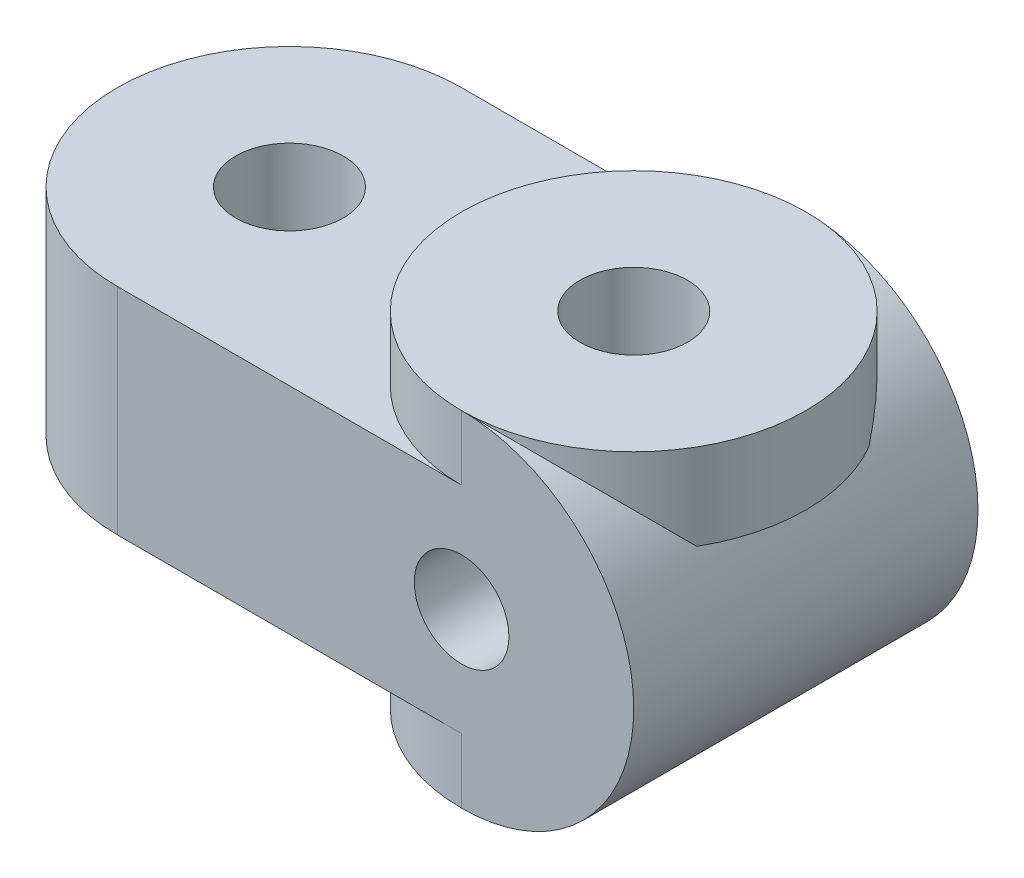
ISO-10303-21;
HEADER;
FILE_DESCRIPTION(('STEP AP214'),'2;1');
FILE_NAME('part.step','',(''),(''),'','','');
FILE_SCHEMA(('AUTOMOTIVE_DESIGN { 1 0 10303 214 1 1 1 1 }'));
ENDSEC;
DATA;
#1=APPLICATION_CONTEXT('core data for automotive mechanical design processes');
#2=APPLICATION_PROTOCOL_DEFINITION('international standard','automotive_design',2000,#1);
#3=PRODUCT_CONTEXT('',#1,'mechanical');
#4=PRODUCT('Part','Part','',(#3));
#5=PRODUCT_RELATED_PRODUCT_CATEGORY('part','',(#4));
#6=PRODUCT_DEFINITION_FORMATION('','',#4);
#7=PRODUCT_DEFINITION_CONTEXT('part definition',#1,'design');
#8=PRODUCT_DEFINITION('design','',#6,#7);
#9=PRODUCT_DEFINITION_SHAPE('','',#8);
#10=(LENGTH_UNIT() NAMED_UNIT(*) SI_UNIT(.MILLI.,.METRE.));
#11=(NAMED_UNIT(*) PLANE_ANGLE_UNIT() SI_UNIT($,.RADIAN.));
#12=(NAMED_UNIT(*) SI_UNIT($,.STERADIAN.) SOLID_ANGLE_UNIT());
#13=UNCERTAINTY_MEASURE_WITH_UNIT(LENGTH_MEASURE(1.E-05),#10,'distance_accuracy_value','');
#14=(GEOMETRIC_REPRESENTATION_CONTEXT(3) GLOBAL_UNCERTAINTY_ASSIGNED_CONTEXT((#13)) GLOBAL_UNIT_ASSIGNED_CONTEXT((#10,
#11,#12)) REPRESENTATION_CONTEXT('',''));
#15=CARTESIAN_POINT('',(0.,0.,0.));
#16=DIRECTION('',(0.,0.,1.));
#17=DIRECTION('',(1.,0.,0.));
#18=AXIS2_PLACEMENT_3D('',#15,#16,#17);
#19=CARTESIAN_POINT('',(-8.,-4.,-4.));
#20=DIRECTION('',(0.,1.,0.));
#21=DIRECTION('',(0.,0.,1.));
#22=AXIS2_PLACEMENT_3D('',#19,#20,#21);
#23=CYLINDRICAL_SURFACE('',#22,1.25);
#24=CARTESIAN_POINT('',(-8.,2.5,-4.));
#25=DIRECTION('',(0.,1.,0.));
#26=DIRECTION('',(0.,0.,1.));
#27=AXIS2_PLACEMENT_3D('',#24,#25,#26);
#28=CIRCLE('',#27,1.25);
#29=CARTESIAN_POINT('',(-8.,2.5,-2.75));
#30=VERTEX_POINT('',#29);
#31=EDGE_CURVE('E224',#30,#30,#28,.F.);
#32=ORIENTED_EDGE('',*,*,#31,.F.);
#33=EDGE_LOOP('',(#32));
#34=FACE_BOUND('',#33,.T.);
#35=CARTESIAN_POINT('',(-8.,-2.5,-4.));
#36=DIRECTION('',(0.,1.,0.));
#37=DIRECTION('',(0.,0.,1.));
#38=AXIS2_PLACEMENT_3D('',#35,#36,#37);
#39=CIRCLE('',#38,1.25);
#40=CARTESIAN_POINT('',(-8.,-2.5,-2.75));
#41=VERTEX_POINT('',#40);
#42=EDGE_CURVE('E227',#41,#41,#39,.F.);
#43=ORIENTED_EDGE('',*,*,#42,.T.);
#44=EDGE_LOOP('',(#43));
#45=FACE_BOUND('',#44,.T.);
#46=ADVANCED_FACE('F60',(#34,#45),#23,.F.);
#47=CARTESIAN_POINT('',(-8.,-4.,-4.));
#48=DIRECTION('',(0.,1.,0.));
#49=DIRECTION('',(0.,0.,1.));
#50=AXIS2_PLACEMENT_3D('',#47,#48,#49);
#51=CYLINDRICAL_SURFACE('',#50,4.);
#52=DIRECTION('',(0.,1.,0.));
#53=VECTOR('',#52,1.);
#54=CARTESIAN_POINT('',(-8.,-4.,-8.));
#55=LINE('',#54,#53);
#56=CARTESIAN_POINT('',(-8.,-2.5,-8.));
#57=VERTEX_POINT('',#56);
#58=CARTESIAN_POINT('',(-8.,2.5,-8.));
#59=VERTEX_POINT('',#58);
#60=EDGE_CURVE('E86',#57,#59,#55,.T.);
#61=ORIENTED_EDGE('',*,*,#60,.F.);
#62=CARTESIAN_POINT('',(-8.,-2.5,-4.));
#63=DIRECTION('',(0.,1.,0.));
#64=DIRECTION('',(0.,0.,1.));
#65=AXIS2_PLACEMENT_3D('',#62,#63,#64);
#66=CIRCLE('',#65,4.);
#67=CARTESIAN_POINT('',(-8.,-2.5,0.));
#68=VERTEX_POINT('',#67);
#69=EDGE_CURVE('E132',#57,#68,#66,.T.);
#70=ORIENTED_EDGE('',*,*,#69,.T.);
#71=DIRECTION('',(0.,1.,0.));
#72=VECTOR('',#71,1.);
#73=CARTESIAN_POINT('',(-8.,-4.,0.));
#74=LINE('',#73,#72);
#75=CARTESIAN_POINT('',(-8.,2.5,0.));
#76=VERTEX_POINT('',#75);
#77=EDGE_CURVE('E140',#68,#76,#74,.T.);
#78=ORIENTED_EDGE('',*,*,#77,.T.);
#79=CARTESIAN_POINT('',(-8.,2.5,-4.));
#80=DIRECTION('',(0.,1.,0.));
#81=DIRECTION('',(0.,0.,1.));
#82=AXIS2_PLACEMENT_3D('',#79,#80,#81);
#83=CIRCLE('',#82,4.);
#84=EDGE_CURVE('E242',#59,#76,#83,.T.);
#85=ORIENTED_EDGE('',*,*,#84,.F.);
#86=EDGE_LOOP('',(#61,#70,#78,#85));
#87=FACE_BOUND('',#86,.T.);
#88=ADVANCED_FACE('F138',(#87),#51,.T.);
#89=CARTESIAN_POINT('',(-12.,4.,-8.));
#90=DIRECTION('',(0.,1.,0.));
#91=DIRECTION('',(0.,0.,1.));
#92=AXIS2_PLACEMENT_3D('',#89,#90,#91);
#93=PLANE('',#92);
#94=CARTESIAN_POINT('',(0.,4.,-4.));
#95=DIRECTION('',(0.,1.,0.));
#96=DIRECTION('',(0.,0.,1.));
#97=AXIS2_PLACEMENT_3D('',#94,#95,#96);
#98=CIRCLE('',#97,1.25);
#99=CARTESIAN_POINT('',(0.,4.,-2.75));
#100=VERTEX_POINT('',#99);
#101=EDGE_CURVE('E273',#100,#100,#98,.T.);
#102=ORIENTED_EDGE('',*,*,#101,.F.);
#103=EDGE_LOOP('',(#102));
#104=FACE_BOUND('',#103,.T.);
#105=CARTESIAN_POINT('',(0.,4.,-4.));
#106=DIRECTION('',(0.,1.,0.));
#107=DIRECTION('',(0.,0.,1.));
#108=AXIS2_PLACEMENT_3D('',#105,#106,#107);
#109=CIRCLE('',#108,4.);
#110=CARTESIAN_POINT('',(0.,4.,0.));
#111=VERTEX_POINT('',#110);
#112=CARTESIAN_POINT('',(0.,4.,-8.));
#113=VERTEX_POINT('',#112);
#114=EDGE_CURVE('E183',#111,#113,#109,.T.);
#115=ORIENTED_EDGE('',*,*,#114,.T.);
#116=CARTESIAN_POINT('',(0.,4.,-4.));
#117=DIRECTION('',(0.,1.,0.));
#118=DIRECTION('',(0.,0.,1.));
#119=AXIS2_PLACEMENT_3D('',#116,#117,#118);
#120=CIRCLE('',#119,4.);
#121=EDGE_CURVE('E236',#113,#111,#120,.T.);
#122=ORIENTED_EDGE('',*,*,#121,.T.);
#123=EDGE_LOOP('',(#115,#122));
#124=FACE_BOUND('',#123,.T.);
#125=ADVANCED_FACE('F197',(#104,#124),#93,.T.);
#126=CARTESIAN_POINT('',(-12.,-4.,-8.));
#127=DIRECTION('',(0.,-1.,0.));
#128=DIRECTION('',(0.,0.,-1.));
#129=AXIS2_PLACEMENT_3D('',#126,#127,#128);
#130=PLANE('',#129);
#131=CARTESIAN_POINT('',(0.,-4.,-4.));
#132=DIRECTION('',(0.,1.,0.));
#133=DIRECTION('',(0.,0.,1.));
#134=AXIS2_PLACEMENT_3D('',#131,#132,#133);
#135=CIRCLE('',#134,4.);
#136=CARTESIAN_POINT('',(0.,-4.,-8.));
#137=VERTEX_POINT('',#136);
#138=CARTESIAN_POINT('',(0.,-4.,0.));
#139=VERTEX_POINT('',#138);
#140=EDGE_CURVE('E234',#137,#139,#135,.T.);
#141=ORIENTED_EDGE('',*,*,#140,.F.);
#142=DIRECTION('',(0.,0.,-1.));
#143=VECTOR('',#142,1.);
#144=CARTESIAN_POINT('',(0.,-4.,-8.));
#145=LINE('',#144,#143);
#146=CARTESIAN_POINT('',(0.,-4.,-5.25));
#147=VERTEX_POINT('',#146);
#148=EDGE_CURVE('E262',#147,#137,#145,.T.);
#149=ORIENTED_EDGE('',*,*,#148,.F.);
#150=CARTESIAN_POINT('',(0.,-4.,-4.));
#151=DIRECTION('',(0.,1.,0.));
#152=DIRECTION('',(0.,0.,1.));
#153=AXIS2_PLACEMENT_3D('',#150,#151,#152);
#154=CIRCLE('',#153,1.25);
#155=CARTESIAN_POINT('',(0.,-4.,-2.75));
#156=VERTEX_POINT('',#155);
#157=EDGE_CURVE('E150',#147,#156,#154,.T.);
#158=ORIENTED_EDGE('',*,*,#157,.T.);
#159=EDGE_CURVE('E279',#139,#156,#145,.T.);
#160=ORIENTED_EDGE('',*,*,#159,.F.);
#161=EDGE_LOOP('',(#141,#149,#158,#160));
#162=FACE_BOUND('',#161,.T.);
#163=ADVANCED_FACE('F200',(#162),#130,.T.);
#164=CARTESIAN_POINT('',(0.,0.,-8.));
#165=DIRECTION('',(0.,0.,1.));
#166=DIRECTION('',(1.,0.,0.));
#167=AXIS2_PLACEMENT_3D('',#164,#165,#166);
#168=CYLINDRICAL_SURFACE('',#167,1.1);
#169=CARTESIAN_POINT('',(0.,1.1,-2.75));
#170=CARTESIAN_POINT('',(0.0513412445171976,1.09999573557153,-2.75000419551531));
#171=CARTESIAN_POINT('',(0.102726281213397,1.09637585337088,-2.75319290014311));
#172=CARTESIAN_POINT('',(0.203784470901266,1.08216750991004,-2.76566800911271));
#173=CARTESIAN_POINT('',(0.253455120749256,1.07156927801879,-2.7749629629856));
#174=CARTESIAN_POINT('',(0.349348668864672,1.04423498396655,-2.79879968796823));
#175=CARTESIAN_POINT('',(0.395591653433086,1.02753876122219,-2.81330739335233));
#176=CARTESIAN_POINT('',(0.48414179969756,0.988910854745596,-2.84659238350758));
#177=CARTESIAN_POINT('',(0.526447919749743,0.966977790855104,-2.86537079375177));
#178=CARTESIAN_POINT('',(0.622378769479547,0.909329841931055,-2.91415555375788));
#179=CARTESIAN_POINT('',(0.673999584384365,0.8715735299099,-2.94568721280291));
#180=CARTESIAN_POINT('',(0.768739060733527,0.789301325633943,-3.01262102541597));
#181=CARTESIAN_POINT('',(0.811835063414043,0.744767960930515,-3.04803311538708));
#182=CARTESIAN_POINT('',(0.890446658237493,0.648874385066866,-3.12105502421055));
#183=CARTESIAN_POINT('',(0.925773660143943,0.597385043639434,-3.15869611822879));
#184=CARTESIAN_POINT('',(0.987649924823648,0.488345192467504,-3.23232583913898));
#185=CARTESIAN_POINT('',(1.01421934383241,0.430809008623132,-3.2683180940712));
#186=CARTESIAN_POINT('',(1.04720352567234,0.338319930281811,-3.31715794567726));
#187=CARTESIAN_POINT('',(1.05712402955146,0.30606212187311,-3.33272385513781));
#188=CARTESIAN_POINT('',(1.07417374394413,0.239437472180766,-3.36053599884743));
#189=CARTESIAN_POINT('',(1.08130792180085,0.20507451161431,-3.37278812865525));
#190=CARTESIAN_POINT('',(1.0914696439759,0.139991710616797,-3.39066839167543));
#191=CARTESIAN_POINT('',(1.09496883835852,0.109557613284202,-3.39703859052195));
#192=CARTESIAN_POINT('',(1.09938845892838,0.0479100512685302,-3.40513168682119));
#193=CARTESIAN_POINT('',(1.10031348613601,0.0166980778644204,-3.40686287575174));
#194=CARTESIAN_POINT('',(1.09949677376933,-0.0455913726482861,-3.40535144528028));
#195=CARTESIAN_POINT('',(1.09775256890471,-0.0766686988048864,-3.40210422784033));
#196=CARTESIAN_POINT('',(1.09176676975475,-0.137819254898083,-3.39124542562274));
#197=CARTESIAN_POINT('',(1.08752004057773,-0.167890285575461,-3.3836248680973));
#198=CARTESIAN_POINT('',(1.07376046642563,-0.243402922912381,-3.35983249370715));
#199=CARTESIAN_POINT('',(1.06262426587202,-0.287769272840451,-3.34126294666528));
#200=CARTESIAN_POINT('',(1.03579187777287,-0.373025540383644,-3.29982214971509));
#201=CARTESIAN_POINT('',(1.02007653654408,-0.413899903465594,-3.27693297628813));
#202=CARTESIAN_POINT('',(0.987554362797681,-0.485808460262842,-3.23328756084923));
#203=CARTESIAN_POINT('',(0.97139644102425,-0.51732836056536,-3.21283829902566));
#204=CARTESIAN_POINT('',(0.936307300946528,-0.57842089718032,-3.17140601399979));
#205=CARTESIAN_POINT('',(0.917374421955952,-0.607992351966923,-3.15042267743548));
#206=CARTESIAN_POINT('',(0.856464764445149,-0.693824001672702,-3.08766668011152));
#207=CARTESIAN_POINT('',(0.81031879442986,-0.747329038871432,-3.04600482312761));
#208=CARTESIAN_POINT('',(0.71800032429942,-0.835227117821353,-2.97550296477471));
#209=CARTESIAN_POINT('',(0.673995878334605,-0.871250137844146,-2.94583964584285));
#210=CARTESIAN_POINT('',(0.579079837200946,-0.937009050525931,-2.89087551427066));
#211=CARTESIAN_POINT('',(0.528179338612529,-0.966754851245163,-2.86556783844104));
#212=CARTESIAN_POINT('',(0.430615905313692,-1.01335832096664,-2.82557090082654));
#213=CARTESIAN_POINT('',(0.385070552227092,-1.03159877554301,-2.80977297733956));
#214=CARTESIAN_POINT('',(0.290630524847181,-1.06206502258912,-2.78327290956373));
#215=CARTESIAN_POINT('',(0.241742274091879,-1.07430200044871,-2.77256128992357));
#216=CARTESIAN_POINT('',(0.1604173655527,-1.0887090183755,-2.75992711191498));
#217=CARTESIAN_POINT('',(0.128603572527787,-1.09292945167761,-2.75621828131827));
#218=CARTESIAN_POINT('',(0.064532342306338,-1.09857654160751,-2.75125317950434));
#219=CARTESIAN_POINT('',(0.0322748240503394,-1.10000268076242,-2.74999736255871));
#220=CARTESIAN_POINT('',(-0.0513412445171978,-1.09999573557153,-2.75000419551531));
#221=CARTESIAN_POINT('',(-0.102726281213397,-1.09637585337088,-2.75319290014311));
#222=CARTESIAN_POINT('',(-0.203784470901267,-1.08216750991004,-2.76566800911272));
#223=CARTESIAN_POINT('',(-0.253455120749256,-1.07156927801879,-2.7749629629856));
#224=CARTESIAN_POINT('',(-0.349348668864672,-1.04423498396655,-2.79879968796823));
#225=CARTESIAN_POINT('',(-0.395591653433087,-1.02753876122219,-2.81330739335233));
#226=CARTESIAN_POINT('',(-0.48414179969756,-0.988910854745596,-2.84659238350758));
#227=CARTESIAN_POINT('',(-0.526447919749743,-0.966977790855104,-2.86537079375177));
#228=CARTESIAN_POINT('',(-0.622378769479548,-0.909329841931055,-2.91415555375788));
#229=CARTESIAN_POINT('',(-0.673999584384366,-0.871573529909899,-2.94568721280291));
#230=CARTESIAN_POINT('',(-0.768739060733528,-0.789301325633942,-3.01262102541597));
#231=CARTESIAN_POINT('',(-0.811835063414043,-0.744767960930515,-3.04803311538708));
#232=CARTESIAN_POINT('',(-0.890446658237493,-0.648874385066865,-3.12105502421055));
#233=CARTESIAN_POINT('',(-0.925773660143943,-0.597385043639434,-3.15869611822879));
#234=CARTESIAN_POINT('',(-0.987649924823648,-0.488345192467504,-3.23232583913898));
#235=CARTESIAN_POINT('',(-1.01421934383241,-0.430809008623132,-3.2683180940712));
#236=CARTESIAN_POINT('',(-1.04720352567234,-0.338319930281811,-3.31715794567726));
#237=CARTESIAN_POINT('',(-1.05712402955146,-0.30606212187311,-3.33272385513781));
#238=CARTESIAN_POINT('',(-1.07417374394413,-0.239437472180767,-3.36053599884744));
#239=CARTESIAN_POINT('',(-1.08130792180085,-0.20507451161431,-3.37278812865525));
#240=CARTESIAN_POINT('',(-1.0914696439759,-0.139991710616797,-3.39066839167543));
#241=CARTESIAN_POINT('',(-1.09496883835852,-0.109557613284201,-3.39703859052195));
#242=CARTESIAN_POINT('',(-1.09938845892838,-0.04791005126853,-3.4051316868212));
#243=CARTESIAN_POINT('',(-1.10031348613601,-0.0166980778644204,-3.40686287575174));
#244=CARTESIAN_POINT('',(-1.09949677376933,0.0455913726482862,-3.40535144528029));
#245=CARTESIAN_POINT('',(-1.09775256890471,0.0766686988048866,-3.40210422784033));
#246=CARTESIAN_POINT('',(-1.09176676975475,0.137819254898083,-3.39124542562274));
#247=CARTESIAN_POINT('',(-1.08752004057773,0.167890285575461,-3.3836248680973));
#248=CARTESIAN_POINT('',(-1.07376046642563,0.243402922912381,-3.35983249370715));
#249=CARTESIAN_POINT('',(-1.06262426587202,0.28776927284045,-3.34126294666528));
#250=CARTESIAN_POINT('',(-1.03579187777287,0.373025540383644,-3.29982214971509));
#251=CARTESIAN_POINT('',(-1.02007653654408,0.413899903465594,-3.27693297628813));
#252=CARTESIAN_POINT('',(-0.987554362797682,0.485808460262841,-3.23328756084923));
#253=CARTESIAN_POINT('',(-0.971396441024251,0.51732836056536,-3.21283829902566));
#254=CARTESIAN_POINT('',(-0.936307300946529,0.578420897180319,-3.17140601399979));
#255=CARTESIAN_POINT('',(-0.917374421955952,0.607992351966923,-3.15042267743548));
#256=CARTESIAN_POINT('',(-0.856464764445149,0.693824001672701,-3.08766668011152));
#257=CARTESIAN_POINT('',(-0.810318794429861,0.747329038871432,-3.04600482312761));
#258=CARTESIAN_POINT('',(-0.71800032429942,0.835227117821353,-2.97550296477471));
#259=CARTESIAN_POINT('',(-0.673995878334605,0.871250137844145,-2.94583964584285));
#260=CARTESIAN_POINT('',(-0.579079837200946,0.937009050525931,-2.89087551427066));
#261=CARTESIAN_POINT('',(-0.528179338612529,0.966754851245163,-2.86556783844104));
#262=CARTESIAN_POINT('',(-0.430615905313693,1.01335832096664,-2.82557090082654));
#263=CARTESIAN_POINT('',(-0.385070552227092,1.03159877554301,-2.80977297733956));
#264=CARTESIAN_POINT('',(-0.290630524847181,1.06206502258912,-2.78327290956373));
#265=CARTESIAN_POINT('',(-0.241742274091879,1.07430200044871,-2.77256128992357));
#266=CARTESIAN_POINT('',(-0.1604173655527,1.0887090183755,-2.75992711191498));
#267=CARTESIAN_POINT('',(-0.128603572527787,1.09292945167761,-2.75621828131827));
#268=CARTESIAN_POINT('',(-0.0645323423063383,1.09857654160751,-2.75125317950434));
#269=CARTESIAN_POINT('',(-0.0322748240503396,1.10000268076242,-2.74999736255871));
#270=CARTESIAN_POINT('',(0.,1.1,-2.75));
#271=B_SPLINE_CURVE_WITH_KNOTS('',3,(#169,#170,#171,#172,#173,#174,#175,#176,#177,#178,#179,
#180,#181,#182,#183,#184,#185,#186,#187,#188,#189,#190,#191,#192,#193,#194,#195,#196,#197,#198,
#199,#200,#201,#202,#203,#204,#205,#206,#207,#208,#209,#210,#211,#212,#213,#214,#215,#216,#217,
#218,#219,#220,#221,#222,#223,#224,#225,#226,#227,#228,#229,#230,#231,#232,#233,#234,#235,#236,
#237,#238,#239,#240,#241,#242,#243,#244,#245,#246,#247,#248,#249,#250,#251,#252,#253,#254,#255,
#256,#257,#258,#259,#260,#261,#262,#263,#264,#265,#266,#267,#268,#269,#270),.UNSPECIFIED.,.T.,
.F.,(4,2,2,2,2,2,2,2,2,2,2,2,2,2,2,2,2,2,2,2,2,2,2,2,2,2,2,2,2,2,2,2,2,2,2,2,2,2,2,2,2,2,2,2,2,
2,2,2,2,2,4),(0.,0.15388370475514,0.30798332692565,0.46109368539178,0.614244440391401,
0.827006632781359,1.04032695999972,1.25836199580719,1.47589164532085,1.58717724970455,
1.69826354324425,1.79174414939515,1.88505756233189,1.97845721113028,2.07204917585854,
2.21931540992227,2.36720669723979,2.48974612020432,2.6123591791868,2.85710164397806,
3.04886537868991,3.24032412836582,3.39434541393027,3.54807863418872,3.64479717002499,
3.74153361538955,3.89541732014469,4.0495169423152,4.20262730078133,4.35577805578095,
4.56854024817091,4.78186057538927,4.99989561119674,5.2174252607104,5.3287108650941,
5.4397971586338,5.5332777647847,5.62659117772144,5.71999082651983,5.81358279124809,
5.96084902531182,6.10874031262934,6.23127973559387,6.35389279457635,6.59863525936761,
6.79039899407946,6.98185774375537,7.13587902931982,7.28961224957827,7.38633078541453,
7.4830672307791),.UNSPECIFIED.);
#272=CARTESIAN_POINT('',(0.,1.1,-2.75));
#273=VERTEX_POINT('',#272);
#274=EDGE_CURVE('E164',#273,#273,#271,.T.);
#275=ORIENTED_EDGE('',*,*,#274,.T.);
#276=EDGE_LOOP('',(#275));
#277=FACE_BOUND('',#276,.T.);
#278=CARTESIAN_POINT('',(0.,0.,0.));
#279=DIRECTION('',(0.,0.,1.));
#280=DIRECTION('',(1.,0.,0.));
#281=AXIS2_PLACEMENT_3D('',#278,#279,#280);
#282=CIRCLE('',#281,1.1);
#283=CARTESIAN_POINT('',(1.1,0.,0.));
#284=VERTEX_POINT('',#283);
#285=EDGE_CURVE('E282',#284,#284,#282,.T.);
#286=ORIENTED_EDGE('',*,*,#285,.T.);
#287=EDGE_LOOP('',(#286));
#288=FACE_BOUND('',#287,.T.);
#289=ADVANCED_FACE('F204',(#277,#288),#168,.F.);
#290=CARTESIAN_POINT('',(0.,0.,-8.));
#291=DIRECTION('',(0.,0.,1.));
#292=DIRECTION('',(1.,0.,0.));
#293=AXIS2_PLACEMENT_3D('',#290,#291,#292);
#294=CIRCLE('',#293,1.1);
#295=CARTESIAN_POINT('',(1.1,0.,-8.));
#296=VERTEX_POINT('',#295);
#297=EDGE_CURVE('E70',#296,#296,#294,.T.);
#298=ORIENTED_EDGE('',*,*,#297,.F.);
#299=EDGE_LOOP('',(#298));
#300=FACE_BOUND('',#299,.T.);
#301=CARTESIAN_POINT('',(0.,-1.1,-5.25));
#302=CARTESIAN_POINT('',(0.0513412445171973,-1.09999573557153,-5.24999580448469));
#303=CARTESIAN_POINT('',(0.102726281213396,-1.09637585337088,-5.24680709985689));
#304=CARTESIAN_POINT('',(0.203784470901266,-1.08216750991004,-5.23433199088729));
#305=CARTESIAN_POINT('',(0.253455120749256,-1.07156927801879,-5.22503703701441));
#306=CARTESIAN_POINT('',(0.349348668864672,-1.04423498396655,-5.20120031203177));
#307=CARTESIAN_POINT('',(0.395591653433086,-1.0275387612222,-5.18669260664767));
#308=CARTESIAN_POINT('',(0.48414179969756,-0.988910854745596,-5.15340761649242));
#309=CARTESIAN_POINT('',(0.526447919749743,-0.966977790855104,-5.13462920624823));
#310=CARTESIAN_POINT('',(0.622378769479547,-0.909329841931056,-5.08584444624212));
#311=CARTESIAN_POINT('',(0.673999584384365,-0.8715735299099,-5.05431278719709));
#312=CARTESIAN_POINT('',(0.768739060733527,-0.789301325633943,-4.98737897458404));
#313=CARTESIAN_POINT('',(0.811835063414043,-0.744767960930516,-4.95196688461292));
#314=CARTESIAN_POINT('',(0.890446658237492,-0.648874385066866,-4.87894497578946));
#315=CARTESIAN_POINT('',(0.925773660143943,-0.597385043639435,-4.84130388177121));
#316=CARTESIAN_POINT('',(0.987649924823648,-0.488345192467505,-4.76767416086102));
#317=CARTESIAN_POINT('',(1.01421934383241,-0.430809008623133,-4.7316819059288));
#318=CARTESIAN_POINT('',(1.04720352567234,-0.338319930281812,-4.68284205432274));
#319=CARTESIAN_POINT('',(1.05712402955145,-0.306062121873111,-4.66727614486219));
#320=CARTESIAN_POINT('',(1.07417374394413,-0.239437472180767,-4.63946400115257));
#321=CARTESIAN_POINT('',(1.08130792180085,-0.205074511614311,-4.62721187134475));
#322=CARTESIAN_POINT('',(1.0914696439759,-0.139991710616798,-4.60933160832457));
#323=CARTESIAN_POINT('',(1.09496883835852,-0.109557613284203,-4.60296140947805));
#324=CARTESIAN_POINT('',(1.09938845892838,-0.0479100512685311,-4.5948683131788));
#325=CARTESIAN_POINT('',(1.10031348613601,-0.0166980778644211,-4.59313712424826));
#326=CARTESIAN_POINT('',(1.09949677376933,0.0455913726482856,-4.59464855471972));
#327=CARTESIAN_POINT('',(1.09775256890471,0.0766686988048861,-4.59789577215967));
#328=CARTESIAN_POINT('',(1.09176676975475,0.137819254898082,-4.60875457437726));
#329=CARTESIAN_POINT('',(1.08752004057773,0.167890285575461,-4.6163751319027));
#330=CARTESIAN_POINT('',(1.07376046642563,0.243402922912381,-4.64016750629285));
#331=CARTESIAN_POINT('',(1.06262426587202,0.287769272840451,-4.65873705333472));
#332=CARTESIAN_POINT('',(1.03579187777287,0.373025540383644,-4.70017785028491));
#333=CARTESIAN_POINT('',(1.02007653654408,0.413899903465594,-4.72306702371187));
#334=CARTESIAN_POINT('',(0.987554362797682,0.485808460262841,-4.76671243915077));
#335=CARTESIAN_POINT('',(0.971396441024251,0.51732836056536,-4.78716170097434));
#336=CARTESIAN_POINT('',(0.936307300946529,0.578420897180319,-4.82859398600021));
#337=CARTESIAN_POINT('',(0.917374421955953,0.607992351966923,-4.84957732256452));
#338=CARTESIAN_POINT('',(0.856464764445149,0.693824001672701,-4.91233331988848));
#339=CARTESIAN_POINT('',(0.810318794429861,0.747329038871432,-4.95399517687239));
#340=CARTESIAN_POINT('',(0.718000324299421,0.835227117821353,-5.02449703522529));
#341=CARTESIAN_POINT('',(0.673995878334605,0.871250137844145,-5.05416035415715));
#342=CARTESIAN_POINT('',(0.579079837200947,0.937009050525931,-5.10912448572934));
#343=CARTESIAN_POINT('',(0.528179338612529,0.966754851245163,-5.13443216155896));
#344=CARTESIAN_POINT('',(0.430615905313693,1.01335832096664,-5.17442909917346));
#345=CARTESIAN_POINT('',(0.385070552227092,1.03159877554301,-5.19022702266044));
#346=CARTESIAN_POINT('',(0.290630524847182,1.06206502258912,-5.21672709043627));
#347=CARTESIAN_POINT('',(0.241742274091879,1.07430200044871,-5.22743871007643));
#348=CARTESIAN_POINT('',(0.1604173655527,1.0887090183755,-5.24007288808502));
#349=CARTESIAN_POINT('',(0.128603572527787,1.09292945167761,-5.24378171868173));
#350=CARTESIAN_POINT('',(0.0645323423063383,1.09857654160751,-5.24874682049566));
#351=CARTESIAN_POINT('',(0.0322748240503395,1.10000268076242,-5.25000263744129));
#352=CARTESIAN_POINT('',(-0.0513412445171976,1.09999573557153,-5.24999580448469));
#353=CARTESIAN_POINT('',(-0.102726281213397,1.09637585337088,-5.24680709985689));
#354=CARTESIAN_POINT('',(-0.203784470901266,1.08216750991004,-5.23433199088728));
#355=CARTESIAN_POINT('',(-0.253455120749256,1.07156927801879,-5.22503703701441));
#356=CARTESIAN_POINT('',(-0.349348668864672,1.04423498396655,-5.20120031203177));
#357=CARTESIAN_POINT('',(-0.395591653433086,1.02753876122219,-5.18669260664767));
#358=CARTESIAN_POINT('',(-0.48414179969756,0.988910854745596,-5.15340761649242));
#359=CARTESIAN_POINT('',(-0.526447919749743,0.966977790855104,-5.13462920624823));
#360=CARTESIAN_POINT('',(-0.622378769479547,0.909329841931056,-5.08584444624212));
#361=CARTESIAN_POINT('',(-0.673999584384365,0.8715735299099,-5.05431278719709));
#362=CARTESIAN_POINT('',(-0.768739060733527,0.789301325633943,-4.98737897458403));
#363=CARTESIAN_POINT('',(-0.811835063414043,0.744767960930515,-4.95196688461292));
#364=CARTESIAN_POINT('',(-0.890446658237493,0.648874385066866,-4.87894497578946));
#365=CARTESIAN_POINT('',(-0.925773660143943,0.597385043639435,-4.84130388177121));
#366=CARTESIAN_POINT('',(-0.987649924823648,0.488345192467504,-4.76767416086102));
#367=CARTESIAN_POINT('',(-1.01421934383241,0.430809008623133,-4.7316819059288));
#368=CARTESIAN_POINT('',(-1.04720352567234,0.338319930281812,-4.68284205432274));
#369=CARTESIAN_POINT('',(-1.05712402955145,0.306062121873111,-4.66727614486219));
#370=CARTESIAN_POINT('',(-1.07417374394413,0.239437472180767,-4.63946400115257));
#371=CARTESIAN_POINT('',(-1.08130792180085,0.205074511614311,-4.62721187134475));
#372=CARTESIAN_POINT('',(-1.0914696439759,0.139991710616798,-4.60933160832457));
#373=CARTESIAN_POINT('',(-1.09496883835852,0.109557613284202,-4.60296140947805));
#374=CARTESIAN_POINT('',(-1.09938845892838,0.0479100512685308,-4.5948683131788));
#375=CARTESIAN_POINT('',(-1.10031348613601,0.016698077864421,-4.59313712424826));
#376=CARTESIAN_POINT('',(-1.09949677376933,-0.0455913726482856,-4.59464855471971));
#377=CARTESIAN_POINT('',(-1.09775256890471,-0.0766686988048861,-4.59789577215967));
#378=CARTESIAN_POINT('',(-1.09176676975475,-0.137819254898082,-4.60875457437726));
#379=CARTESIAN_POINT('',(-1.08752004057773,-0.167890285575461,-4.6163751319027));
#380=CARTESIAN_POINT('',(-1.07376046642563,-0.243402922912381,-4.64016750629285));
#381=CARTESIAN_POINT('',(-1.06262426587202,-0.28776927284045,-4.65873705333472));
#382=CARTESIAN_POINT('',(-1.03579187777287,-0.373025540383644,-4.70017785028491));
#383=CARTESIAN_POINT('',(-1.02007653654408,-0.413899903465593,-4.72306702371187));
#384=CARTESIAN_POINT('',(-0.987554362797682,-0.485808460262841,-4.76671243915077));
#385=CARTESIAN_POINT('',(-0.971396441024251,-0.517328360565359,-4.78716170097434));
#386=CARTESIAN_POINT('',(-0.936307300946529,-0.578420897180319,-4.82859398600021));
#387=CARTESIAN_POINT('',(-0.917374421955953,-0.607992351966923,-4.84957732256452));
#388=CARTESIAN_POINT('',(-0.856464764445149,-0.693824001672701,-4.91233331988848));
#389=CARTESIAN_POINT('',(-0.810318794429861,-0.747329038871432,-4.95399517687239));
#390=CARTESIAN_POINT('',(-0.71800032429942,-0.835227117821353,-5.02449703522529));
#391=CARTESIAN_POINT('',(-0.673995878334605,-0.871250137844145,-5.05416035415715));
#392=CARTESIAN_POINT('',(-0.579079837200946,-0.937009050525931,-5.10912448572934));
#393=CARTESIAN_POINT('',(-0.528179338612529,-0.966754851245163,-5.13443216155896));
#394=CARTESIAN_POINT('',(-0.430615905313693,-1.01335832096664,-5.17442909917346));
#395=CARTESIAN_POINT('',(-0.385070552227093,-1.03159877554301,-5.19022702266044));
#396=CARTESIAN_POINT('',(-0.290630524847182,-1.06206502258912,-5.21672709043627));
#397=CARTESIAN_POINT('',(-0.24174227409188,-1.07430200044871,-5.22743871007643));
#398=CARTESIAN_POINT('',(-0.1604173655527,-1.0887090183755,-5.24007288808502));
#399=CARTESIAN_POINT('',(-0.128603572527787,-1.09292945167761,-5.24378171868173));
#400=CARTESIAN_POINT('',(-0.0645323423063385,-1.09857654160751,-5.24874682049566));
#401=CARTESIAN_POINT('',(-0.0322748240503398,-1.10000268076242,-5.25000263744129));
#402=CARTESIAN_POINT('',(0.,-1.1,-5.25));
#403=B_SPLINE_CURVE_WITH_KNOTS('',3,(#301,#302,#303,#304,#305,#306,#307,#308,#309,#310,#311,
#312,#313,#314,#315,#316,#317,#318,#319,#320,#321,#322,#323,#324,#325,#326,#327,#328,#329,#330,
#331,#332,#333,#334,#335,#336,#337,#338,#339,#340,#341,#342,#343,#344,#345,#346,#347,#348,#349,
#350,#351,#352,#353,#354,#355,#356,#357,#358,#359,#360,#361,#362,#363,#364,#365,#366,#367,#368,
#369,#370,#371,#372,#373,#374,#375,#376,#377,#378,#379,#380,#381,#382,#383,#384,#385,#386,#387,
#388,#389,#390,#391,#392,#393,#394,#395,#396,#397,#398,#399,#400,#401,#402),.UNSPECIFIED.,.T.,
.F.,(4,2,2,2,2,2,2,2,2,2,2,2,2,2,2,2,2,2,2,2,2,2,2,2,2,2,2,2,2,2,2,2,2,2,2,2,2,2,2,2,2,2,2,2,2,
2,2,2,2,2,4),(0.,0.15388370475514,0.30798332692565,0.46109368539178,0.614244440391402,
0.827006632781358,1.04032695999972,1.25836199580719,1.47589164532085,1.58717724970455,
1.69826354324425,1.79174414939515,1.88505756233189,1.97845721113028,2.07204917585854,
2.21931540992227,2.36720669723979,2.48974612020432,2.6123591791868,2.85710164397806,
3.04886537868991,3.24032412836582,3.39434541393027,3.54807863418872,3.64479717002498,
3.74153361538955,3.89541732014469,4.0495169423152,4.20262730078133,4.35577805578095,
4.56854024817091,4.78186057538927,4.99989561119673,5.2174252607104,5.3287108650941,
5.43979715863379,5.5332777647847,5.62659117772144,5.71999082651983,5.81358279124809,
5.96084902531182,6.10874031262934,6.23127973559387,6.35389279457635,6.59863525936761,
6.79039899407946,6.98185774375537,7.13587902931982,7.28961224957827,7.38633078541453,
7.4830672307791),.UNSPECIFIED.);
#404=CARTESIAN_POINT('',(0.,-1.1,-5.25));
#405=VERTEX_POINT('',#404);
#406=EDGE_CURVE('E153',#405,#405,#403,.T.);
#407=ORIENTED_EDGE('',*,*,#406,.T.);
#408=EDGE_LOOP('',(#407));
#409=FACE_BOUND('',#408,.T.);
#410=ADVANCED_FACE('F62',(#300,#409),#168,.F.);
#411=CARTESIAN_POINT('',(0.,0.,-8.));
#412=DIRECTION('',(0.,0.,1.));
#413=DIRECTION('',(1.,0.,0.));
#414=AXIS2_PLACEMENT_3D('',#411,#412,#413);
#415=CYLINDRICAL_SURFACE('',#414,4.);
#416=CARTESIAN_POINT('',(0.,-4.,-5.25));
#417=CARTESIAN_POINT('',(0.0342840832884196,-4.00000239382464,-5.250000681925));
#418=CARTESIAN_POINT('',(0.0685509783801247,-3.99955869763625,-5.24858860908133));
#419=CARTESIAN_POINT('',(0.136824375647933,-3.9978046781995,-5.24296130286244));
#420=CARTESIAN_POINT('',(0.170830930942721,-3.99649453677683,-5.23874665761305));
#421=CARTESIAN_POINT('',(0.27191461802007,-3.99131416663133,-5.2219693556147));
#422=CARTESIAN_POINT('',(0.338290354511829,-3.98619364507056,-5.20527297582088));
#423=CARTESIAN_POINT('',(0.467130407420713,-3.97315917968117,-5.16143304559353));
#424=CARTESIAN_POINT('',(0.529595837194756,-3.96524603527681,-5.13429248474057));
#425=CARTESIAN_POINT('',(0.649116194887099,-3.94744238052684,-5.07039296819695));
#426=CARTESIAN_POINT('',(0.706168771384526,-3.93755101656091,-5.03362985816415));
#427=CARTESIAN_POINT('',(0.814964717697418,-3.91650242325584,-4.95034505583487));
#428=CARTESIAN_POINT('',(0.86651755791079,-3.90531774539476,-4.90358154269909));
#429=CARTESIAN_POINT('',(0.961194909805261,-3.88310103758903,-4.80213447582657));
#430=CARTESIAN_POINT('',(1.00431741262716,-3.87206904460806,-4.74744903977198));
#431=CARTESIAN_POINT('',(1.0819443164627,-3.85111120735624,-4.63005408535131));
#432=CARTESIAN_POINT('',(1.11620940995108,-3.84121943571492,-4.56717966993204));
#433=CARTESIAN_POINT('',(1.17359844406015,-3.82407768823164,-4.43620460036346));
#434=CARTESIAN_POINT('',(1.19672582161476,-3.81682689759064,-4.36810556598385));
#435=CARTESIAN_POINT('',(1.23048442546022,-3.80607612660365,-4.23077264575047));
#436=CARTESIAN_POINT('',(1.24147086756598,-3.80246980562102,-4.16163463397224));
#437=CARTESIAN_POINT('',(1.25174556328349,-3.79910054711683,-4.02240837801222));
#438=CARTESIAN_POINT('',(1.25103667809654,-3.79933666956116,-3.95232037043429));
#439=CARTESIAN_POINT('',(1.23821821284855,-3.80353190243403,-3.81612515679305));
#440=CARTESIAN_POINT('',(1.2265604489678,-3.80734346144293,-3.74997011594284));
#441=CARTESIAN_POINT('',(1.19290787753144,-3.8180203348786,-3.62060711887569));
#442=CARTESIAN_POINT('',(1.17091208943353,-3.82488593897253,-3.55739944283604));
#443=CARTESIAN_POINT('',(1.11688861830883,-3.84101048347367,-3.43464772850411));
#444=CARTESIAN_POINT('',(1.08471897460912,-3.85030294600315,-3.37517076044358));
#445=CARTESIAN_POINT('',(1.01135970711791,-3.87021867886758,-3.26231165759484));
#446=CARTESIAN_POINT('',(0.970167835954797,-3.880842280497,-3.20893104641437));
#447=CARTESIAN_POINT('',(0.877721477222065,-3.90281426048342,-3.10722978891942));
#448=CARTESIAN_POINT('',(0.826094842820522,-3.9141736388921,-3.05924921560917));
#449=CARTESIAN_POINT('',(0.715374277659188,-3.93591380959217,-2.97253510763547));
#450=CARTESIAN_POINT('',(0.656278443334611,-3.94629435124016,-2.93380393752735));
#451=CARTESIAN_POINT('',(0.531631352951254,-3.9650184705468,-2.8664527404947));
#452=CARTESIAN_POINT('',(0.466030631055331,-3.97334444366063,-2.8379192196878));
#453=CARTESIAN_POINT('',(0.330673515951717,-3.98688561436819,-2.79242625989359));
#454=CARTESIAN_POINT('',(0.260923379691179,-3.99210537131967,-2.77544985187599));
#455=CARTESIAN_POINT('',(0.158762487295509,-3.9969734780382,-2.75971231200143));
#456=CARTESIAN_POINT('',(0.127106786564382,-3.99810617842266,-2.7560707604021));
#457=CARTESIAN_POINT('',(0.0636394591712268,-3.99961949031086,-2.75121668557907));
#458=CARTESIAN_POINT('',(0.0318281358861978,-4.0000012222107,-2.75000054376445));
#459=CARTESIAN_POINT('',(0.,-4.00000000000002,-2.74999999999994));
#460=B_SPLINE_CURVE_WITH_KNOTS('',3,(#416,#417,#418,#419,#420,#421,#422,#423,#424,#425,#426,
#427,#428,#429,#430,#431,#432,#433,#434,#435,#436,#437,#438,#439,#440,#441,#442,#443,#444,#445,
#446,#447,#448,#449,#450,#451,#452,#453,#454,#455,#456,#457,#458,#459),.UNSPECIFIED.,.F.,.F.,(4,
2,2,2,2,2,2,2,2,2,2,2,2,2,2,2,2,2,2,2,2,4),(0.,0.1027866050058,0.205551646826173,
0.41038725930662,0.61516428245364,0.820029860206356,1.03056268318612,1.24114561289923,
1.45693252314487,1.67265280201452,1.88187921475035,2.09105444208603,2.29196026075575,
2.49288513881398,2.69674744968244,2.90066059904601,3.11383808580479,3.32707001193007,
3.54207008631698,3.75675379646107,3.8523221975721,3.94774790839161),.UNSPECIFIED.);
#461=EDGE_CURVE('E177',#147,#156,#460,.T.);
#462=ORIENTED_EDGE('',*,*,#461,.F.);
#463=ORIENTED_EDGE('',*,*,#148,.T.);
#464=CARTESIAN_POINT('',(0.,0.,-8.));
#465=DIRECTION('',(0.,0.,1.));
#466=DIRECTION('',(1.,0.,0.));
#467=AXIS2_PLACEMENT_3D('',#464,#465,#466);
#468=CIRCLE('',#467,4.);
#469=EDGE_CURVE('E12',#137,#113,#468,.T.);
#470=ORIENTED_EDGE('',*,*,#469,.T.);
#471=CARTESIAN_POINT('',(0.,0.,-4.));
#472=DIRECTION('',(0.,0.707106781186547,0.707106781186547));
#473=DIRECTION('',(0.,-0.707106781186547,0.707106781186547));
#474=AXIS2_PLACEMENT_3D('',#471,#472,#473);
#475=ELLIPSE('',#474,5.65685424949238,4.);
#476=CARTESIAN_POINT('',(3.46410161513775,2.,-6.));
#477=VERTEX_POINT('',#476);
#478=EDGE_CURVE('E259',#477,#113,#475,.T.);
#479=ORIENTED_EDGE('',*,*,#478,.F.);
#480=DIRECTION('',(0.,0.,1.));
#481=VECTOR('',#480,1.);
#482=CARTESIAN_POINT('',(3.46410161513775,2.,-8.));
#483=LINE('',#482,#481);
#484=CARTESIAN_POINT('',(3.46410161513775,2.,-2.));
#485=VERTEX_POINT('',#484);
#486=EDGE_CURVE('E268',#477,#485,#483,.T.);
#487=ORIENTED_EDGE('',*,*,#486,.T.);
#488=CARTESIAN_POINT('',(0.,0.,-4.));
#489=DIRECTION('',(0.,-0.707106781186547,0.707106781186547));
#490=DIRECTION('',(0.,0.707106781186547,0.707106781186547));
#491=AXIS2_PLACEMENT_3D('',#488,#489,#490);
#492=ELLIPSE('',#491,5.65685424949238,4.);
#493=EDGE_CURVE('E269',#111,#485,#492,.F.);
#494=ORIENTED_EDGE('',*,*,#493,.F.);
#495=CARTESIAN_POINT('',(0.,0.,0.));
#496=DIRECTION('',(0.,0.,1.));
#497=DIRECTION('',(1.,0.,0.));
#498=AXIS2_PLACEMENT_3D('',#495,#496,#497);
#499=CIRCLE('',#498,4.);
#500=EDGE_CURVE('E65',#139,#111,#499,.T.);
#501=ORIENTED_EDGE('',*,*,#500,.F.);
#502=ORIENTED_EDGE('',*,*,#159,.T.);
#503=EDGE_LOOP('',(#462,#463,#470,#479,#487,#494,#501,#502));
#504=FACE_BOUND('',#503,.T.);
#505=ADVANCED_FACE('F186',(#504),#415,.T.);
#506=CARTESIAN_POINT('',(0.,0.,-8.));
#507=DIRECTION('',(0.,0.,1.));
#508=DIRECTION('',(1.,0.,0.));
#509=AXIS2_PLACEMENT_3D('',#506,#507,#508);
#510=PLANE('',#509);
#511=ORIENTED_EDGE('',*,*,#469,.F.);
#512=DIRECTION('',(0.,-1.,0.));
#513=VECTOR('',#512,1.);
#514=CARTESIAN_POINT('',(0.,-2.5,-8.));
#515=LINE('',#514,#513);
#516=CARTESIAN_POINT('',(0.,-2.5,-8.));
#517=VERTEX_POINT('',#516);
#518=EDGE_CURVE('E230',#517,#137,#515,.T.);
#519=ORIENTED_EDGE('',*,*,#518,.F.);
#520=DIRECTION('',(-1.,0.,0.));
#521=VECTOR('',#520,1.);
#522=CARTESIAN_POINT('',(0.,-2.5,-8.));
#523=LINE('',#522,#521);
#524=EDGE_CURVE('E142',#517,#57,#523,.T.);
#525=ORIENTED_EDGE('',*,*,#524,.T.);
#526=ORIENTED_EDGE('',*,*,#60,.T.);
#527=DIRECTION('',(-1.,0.,0.));
#528=VECTOR('',#527,1.);
#529=CARTESIAN_POINT('',(0.,2.5,-8.));
#530=LINE('',#529,#528);
#531=CARTESIAN_POINT('',(0.,2.5,-8.));
#532=VERTEX_POINT('',#531);
#533=EDGE_CURVE('E240',#532,#59,#530,.T.);
#534=ORIENTED_EDGE('',*,*,#533,.F.);
#535=DIRECTION('',(0.,1.,0.));
#536=VECTOR('',#535,1.);
#537=CARTESIAN_POINT('',(0.,2.5,-8.));
#538=LINE('',#537,#536);
#539=EDGE_CURVE('E246',#532,#113,#538,.T.);
#540=ORIENTED_EDGE('',*,*,#539,.T.);
#541=EDGE_LOOP('',(#511,#519,#525,#526,#534,#540));
#542=FACE_BOUND('',#541,.T.);
#543=ORIENTED_EDGE('',*,*,#297,.T.);
#544=EDGE_LOOP('',(#543));
#545=FACE_BOUND('',#544,.T.);
#546=ADVANCED_FACE('F190',(#542,#545),#510,.F.);
#547=CARTESIAN_POINT('',(0.,0.,0.));
#548=DIRECTION('',(0.,0.,1.));
#549=DIRECTION('',(1.,0.,0.));
#550=AXIS2_PLACEMENT_3D('',#547,#548,#549);
#551=PLANE('',#550);
#552=DIRECTION('',(0.,-1.,0.));
#553=VECTOR('',#552,1.);
#554=CARTESIAN_POINT('',(0.,-2.5,0.));
#555=LINE('',#554,#553);
#556=CARTESIAN_POINT('',(0.,-2.5,0.));
#557=VERTEX_POINT('',#556);
#558=EDGE_CURVE('E228',#557,#139,#555,.T.);
#559=ORIENTED_EDGE('',*,*,#558,.T.);
#560=ORIENTED_EDGE('',*,*,#500,.T.);
#561=DIRECTION('',(0.,1.,0.));
#562=VECTOR('',#561,1.);
#563=CARTESIAN_POINT('',(0.,2.5,0.));
#564=LINE('',#563,#562);
#565=CARTESIAN_POINT('',(0.,2.5,0.));
#566=VERTEX_POINT('',#565);
#567=EDGE_CURVE('E155',#566,#111,#564,.T.);
#568=ORIENTED_EDGE('',*,*,#567,.F.);
#569=DIRECTION('',(1.,0.,0.));
#570=VECTOR('',#569,1.);
#571=CARTESIAN_POINT('',(0.,2.5,0.));
#572=LINE('',#571,#570);
#573=EDGE_CURVE('E149',#76,#566,#572,.T.);
#574=ORIENTED_EDGE('',*,*,#573,.F.);
#575=ORIENTED_EDGE('',*,*,#77,.F.);
#576=DIRECTION('',(1.,0.,0.));
#577=VECTOR('',#576,1.);
#578=CARTESIAN_POINT('',(0.,-2.5,0.));
#579=LINE('',#578,#577);
#580=EDGE_CURVE('E128',#68,#557,#579,.T.);
#581=ORIENTED_EDGE('',*,*,#580,.T.);
#582=EDGE_LOOP('',(#559,#560,#568,#574,#575,#581));
#583=FACE_BOUND('',#582,.T.);
#584=ORIENTED_EDGE('',*,*,#285,.F.);
#585=EDGE_LOOP('',(#584));
#586=FACE_BOUND('',#585,.T.);
#587=ADVANCED_FACE('F145',(#583,#586),#551,.T.);
#588=CARTESIAN_POINT('',(0.,2.,-4.));
#589=DIRECTION('',(0.,1.,0.));
#590=DIRECTION('',(0.,0.,1.));
#591=AXIS2_PLACEMENT_3D('',#588,#589,#590);
#592=CYLINDRICAL_SURFACE('',#591,4.);
#593=CARTESIAN_POINT('',(0.,2.,-4.));
#594=DIRECTION('',(0.,1.,0.));
#595=DIRECTION('',(0.,0.,1.));
#596=AXIS2_PLACEMENT_3D('',#593,#594,#595);
#597=CIRCLE('',#596,4.);
#598=EDGE_CURVE('E184',#485,#477,#597,.T.);
#599=ORIENTED_EDGE('',*,*,#598,.T.);
#600=ORIENTED_EDGE('',*,*,#478,.T.);
#601=ORIENTED_EDGE('',*,*,#114,.F.);
#602=ORIENTED_EDGE('',*,*,#493,.T.);
#603=EDGE_LOOP('',(#599,#600,#601,#602));
#604=FACE_BOUND('',#603,.T.);
#605=ADVANCED_FACE('F194',(#604),#592,.T.);
#606=CARTESIAN_POINT('',(0.,2.,-4.));
#607=DIRECTION('',(0.,1.,0.));
#608=DIRECTION('',(0.,0.,1.));
#609=AXIS2_PLACEMENT_3D('',#606,#607,#608);
#610=CYLINDRICAL_SURFACE('',#609,1.25);
#611=ORIENTED_EDGE('',*,*,#101,.T.);
#612=EDGE_LOOP('',(#611));
#613=FACE_BOUND('',#612,.T.);
#614=ORIENTED_EDGE('',*,*,#461,.T.);
#615=ORIENTED_EDGE('',*,*,#157,.F.);
#616=EDGE_LOOP('',(#614,#615));
#617=FACE_BOUND('',#616,.T.);
#618=ORIENTED_EDGE('',*,*,#406,.F.);
#619=EDGE_LOOP('',(#618));
#620=FACE_BOUND('',#619,.T.);
#621=ORIENTED_EDGE('',*,*,#274,.F.);
#622=EDGE_LOOP('',(#621));
#623=FACE_BOUND('',#622,.T.);
#624=ADVANCED_FACE('F208',(#613,#617,#620,#623),#610,.F.);
#625=CARTESIAN_POINT('',(0.,2.,0.));
#626=DIRECTION('',(0.,1.,0.));
#627=DIRECTION('',(0.,0.,1.));
#628=AXIS2_PLACEMENT_3D('',#625,#626,#627);
#629=PLANE('',#628);
#630=ORIENTED_EDGE('',*,*,#486,.F.);
#631=ORIENTED_EDGE('',*,*,#598,.F.);
#632=EDGE_LOOP('',(#630,#631));
#633=FACE_BOUND('',#632,.T.);
#634=ADVANCED_FACE('F212',(#633),#629,.F.);
#635=CARTESIAN_POINT('',(0.,2.5,-4.));
#636=DIRECTION('',(0.,1.,0.));
#637=DIRECTION('',(0.,0.,1.));
#638=AXIS2_PLACEMENT_3D('',#635,#636,#637);
#639=CYLINDRICAL_SURFACE('',#638,4.);
#640=ORIENTED_EDGE('',*,*,#121,.F.);
#641=ORIENTED_EDGE('',*,*,#539,.F.);
#642=CARTESIAN_POINT('',(0.,2.5,-4.));
#643=DIRECTION('',(0.,1.,0.));
#644=DIRECTION('',(0.,0.,1.));
#645=AXIS2_PLACEMENT_3D('',#642,#643,#644);
#646=CIRCLE('',#645,4.);
#647=EDGE_CURVE('E238',#532,#566,#646,.T.);
#648=ORIENTED_EDGE('',*,*,#647,.T.);
#649=ORIENTED_EDGE('',*,*,#567,.T.);
#650=EDGE_LOOP('',(#640,#641,#648,#649));
#651=FACE_BOUND('',#650,.T.);
#652=ADVANCED_FACE('F172',(#651),#639,.T.);
#653=CARTESIAN_POINT('',(0.,2.5,0.));
#654=DIRECTION('',(0.,1.,0.));
#655=DIRECTION('',(0.,0.,1.));
#656=AXIS2_PLACEMENT_3D('',#653,#654,#655);
#657=PLANE('',#656);
#658=ORIENTED_EDGE('',*,*,#647,.F.);
#659=ORIENTED_EDGE('',*,*,#533,.T.);
#660=ORIENTED_EDGE('',*,*,#84,.T.);
#661=ORIENTED_EDGE('',*,*,#573,.T.);
#662=EDGE_LOOP('',(#658,#659,#660,#661));
#663=FACE_BOUND('',#662,.T.);
#664=ORIENTED_EDGE('',*,*,#31,.T.);
#665=EDGE_LOOP('',(#664));
#666=FACE_BOUND('',#665,.T.);
#667=ADVANCED_FACE('F340',(#663,#666),#657,.T.);
#668=CARTESIAN_POINT('',(0.,-2.5,-4.));
#669=DIRECTION('',(0.,-1.,0.));
#670=DIRECTION('',(0.,0.,-1.));
#671=AXIS2_PLACEMENT_3D('',#668,#669,#670);
#672=CYLINDRICAL_SURFACE('',#671,4.);
#673=ORIENTED_EDGE('',*,*,#140,.T.);
#674=ORIENTED_EDGE('',*,*,#558,.F.);
#675=CARTESIAN_POINT('',(0.,-2.5,-4.));
#676=DIRECTION('',(0.,1.,0.));
#677=DIRECTION('',(0.,0.,1.));
#678=AXIS2_PLACEMENT_3D('',#675,#676,#677);
#679=CIRCLE('',#678,4.);
#680=EDGE_CURVE('E78',#517,#557,#679,.T.);
#681=ORIENTED_EDGE('',*,*,#680,.F.);
#682=ORIENTED_EDGE('',*,*,#518,.T.);
#683=EDGE_LOOP('',(#673,#674,#681,#682));
#684=FACE_BOUND('',#683,.T.);
#685=ADVANCED_FACE('F346',(#684),#672,.T.);
#686=CARTESIAN_POINT('',(0.,-2.5,0.));
#687=DIRECTION('',(0.,-1.,0.));
#688=DIRECTION('',(0.,0.,1.));
#689=AXIS2_PLACEMENT_3D('',#686,#687,#688);
#690=PLANE('',#689);
#691=ORIENTED_EDGE('',*,*,#680,.T.);
#692=ORIENTED_EDGE('',*,*,#580,.F.);
#693=ORIENTED_EDGE('',*,*,#69,.F.);
#694=ORIENTED_EDGE('',*,*,#524,.F.);
#695=EDGE_LOOP('',(#691,#692,#693,#694));
#696=FACE_BOUND('',#695,.T.);
#697=ORIENTED_EDGE('',*,*,#42,.F.);
#698=EDGE_LOOP('',(#697));
#699=FACE_BOUND('',#698,.T.);
#700=ADVANCED_FACE('F130',(#696,#699),#690,.T.);
#701=CLOSED_SHELL('',(#46,#88,#125,#163,#289,#410,#505,#546,#587,#605,#624,#634,#652,#667,#685,#700));
#702=MANIFOLD_SOLID_BREP('B2',#701);
#703=ADVANCED_BREP_SHAPE_REPRESENTATION('',(#18,#702),#14);
#704=SHAPE_DEFINITION_REPRESENTATION(#9,#703);
ENDSEC;
END-ISO-10303-21;
